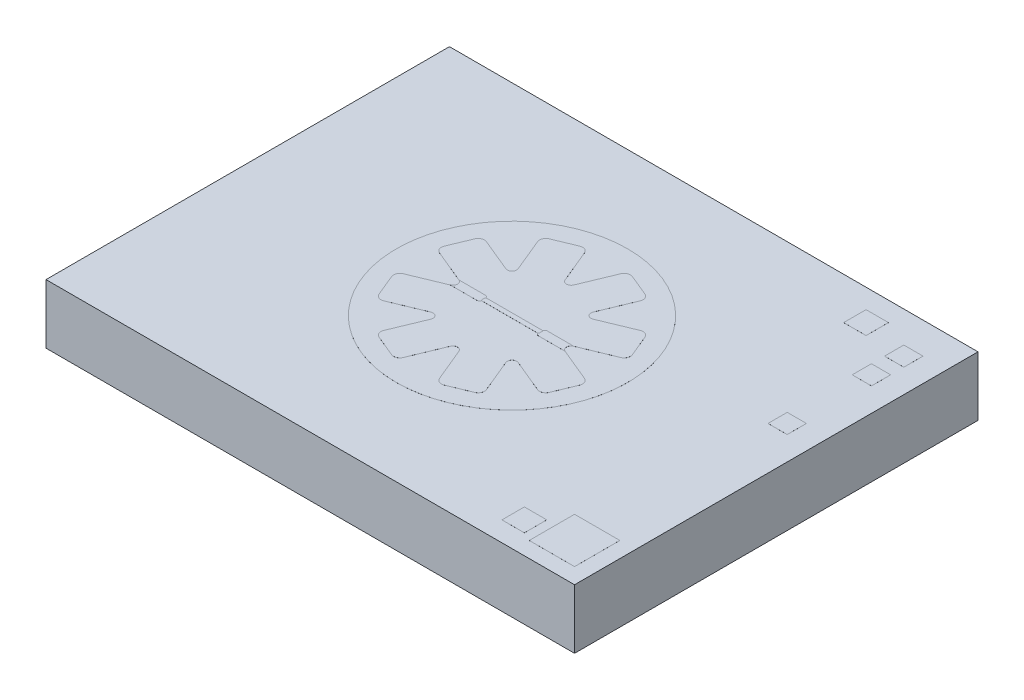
from build123d import *

# Parameters (mm, degrees)
SKETCH1_W                = 4.2926
SKETCH1_H                = 3.2766
DIE_DEPTH                = 0.4826
SKETCH2_R                = 0.9398
BOSS_EXTRUDE1_DEPTH      = 0.000254
BOSS_EXTRUDE2_DEPTH      = 0.000254
FILLET1_R                = 0.0381
FILLET2_R                = 0.0508
BOSS_EXTRUDE3_START      = 0.000254
BOSS_EXTRUDE3_DEPTH      = 0.000254
BOSS_EXTRUDE4_DEPTH      = 0.000508
SKETCH6_W                = 0.181991
SKETCH6_H                = 0.181991
SKETCH6_W_2              = 0.1560068
SKETCH6_H_2              = 0.1560068
SKETCH6_W_3              = 0.368046
SKETCH6_H_3              = 0.368046
TOP_PADS_DEPTH           = 0.000254
SKETCH9_W                = 0.127
SKETCH9_H                = 0.3059938
BOTTOM_PADS_DEPTH        = 0.000508
SKETCH7_W                = 1.521968
SKETCH7_H                = 0.3059938
BOTTOM_METAL_DEPTH       = 0.000254
SKETCH8_W                = 0.681736
SKETCH8_H                = 0.681736
KOH_ETCH_DEPTH           = 0.477854
KOH_ETCH_DRAFT           = -35.3
KOH_ETCH_PROFILE_2_DEPTH = 0.477854
KOH_ETCH_PROFILE_2_DRAFT = -35.3
SKETCH18_W               = 0.127
SKETCH18_H               = 0.3059938
CUT_EXTRUDE1_DEPTH       = 0.0254
CUT_EXTRUDE1_DRAFT       = -35.3


with BuildPart() as part:
    # Sketch1 → die (new body)
    with BuildSketch(Plane(origin=(0, 0, 0), x_dir=(1, 0, 0), z_dir=(0, 1, 0))):
        with Locations((2.1463, 1.6383)):
            Rectangle(SKETCH1_W, SKETCH1_H)
    extrude(amount=DIE_DEPTH)

    # Sketch2 → Boss-Extrude1 (add)
    with BuildSketch(Plane(origin=(0, 0.4826, 0), x_dir=(1, 0, 0), z_dir=(0, 1, 0))):
        with Locations(Location((2.1463, 1.6383, 0), (0, 0, 90))):
            Circle(SKETCH2_R)
    extrude(amount=BOSS_EXTRUDE1_DEPTH)

    # Sketch3 → Boss-Extrude2 (add)
    with BuildSketch(Plane(origin=(0, 0.482854, 0), x_dir=(1, 0, 0), z_dir=(0, 1, 0))):
        Polygon((1.7653, 1.6383), (1.363041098, 1.804921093), (1.474633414, 2.074328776), (1.876892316, 1.907707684), (1.710271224, 2.309966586), (1.979678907, 2.421558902), (2.1463, 2.0193), (2.312921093, 2.421558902), (2.582328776, 2.309966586), (2.415707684, 1.907707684), (2.817966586, 2.074328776), (2.929558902, 1.804921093), (2.5273, 1.6383), (2.929558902, 1.471678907), (2.817966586, 1.202271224), (2.415707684, 1.368892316), (2.582328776, 0.966633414), (2.312921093, 0.855041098), (2.1463, 1.2573), (1.979678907, 0.855041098), (1.710271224, 0.966633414), (1.876892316, 1.368892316), (1.474633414, 1.202271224), (1.363041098, 1.471678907), align=None)
    extrude(amount=BOSS_EXTRUDE2_DEPTH)

    # Fillet1
    fillet1_edges = [part.edges().sort_by_distance(p)[0] for p in [
        (1.7653, 0.482981, -1.6383),
        (1.876892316, 0.482981, -1.368892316),
        (2.1463, 0.482981, -1.2573),
        (2.415707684, 0.482981, -1.368892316),
        (2.5273, 0.482981, -1.6383),
        (2.415707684, 0.482981, -1.907707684),
        (2.1463, 0.482981, -2.0193),
        (1.876892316, 0.482981, -1.907707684),
    ]]
    fillet(fillet1_edges, radius=FILLET1_R)

    # Fillet2
    fillet2_edges = [part.edges().sort_by_distance(p)[0] for p in [
        (1.363041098, 0.482981, -1.471678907),
        (1.474633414, 0.482981, -1.202271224),
        (1.710271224, 0.482981, -0.966633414),
        (1.979678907, 0.482981, -0.855041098),
        (2.312921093, 0.482981, -0.855041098),
        (2.582328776, 0.482981, -0.966633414),
        (2.817966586, 0.482981, -1.202271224),
        (2.929558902, 0.482981, -1.471678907),
        (2.929558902, 0.482981, -1.804921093),
        (2.817966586, 0.482981, -2.074328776),
        (2.582328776, 0.482981, -2.309966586),
        (2.312921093, 0.482981, -2.421558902),
        (1.979678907, 0.482981, -2.421558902),
        (1.710271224, 0.482981, -2.309966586),
        (1.474633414, 0.482981, -2.074328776),
        (1.363041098, 0.482981, -1.804921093),
    ]]
    fillet(fillet2_edges, radius=FILLET2_R)

    # Sketch4 → Boss-Extrude3 (add)
    with BuildSketch(Plane(origin=(0, 0.483108, 0), x_dir=(1, 0, 0), z_dir=(0, 1, 0)).offset(BOSS_EXTRUDE3_START)):
        with BuildLine():
            Line((1.680320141, 1.60310019), (1.89520019, 1.60310019))
            ThreePointArc((1.89520019, 1.60310019), (1.911109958, 1.609690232), (1.9177, 1.6256))
            Line((1.9177, 1.6256), (2.3749, 1.6256))
            ThreePointArc((2.3749, 1.6256), (2.381490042, 1.609690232), (2.39739981, 1.60310019))
            Line((2.39739981, 1.60310019), (2.612279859, 1.60310019))
            ThreePointArc((2.612279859, 1.60310019), (2.588760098, 1.6383), (2.612279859, 1.67349981))
            Line((2.612279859, 1.67349981), (2.39739981, 1.67349981))
            ThreePointArc((2.39739981, 1.67349981), (2.381490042, 1.666909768), (2.3749, 1.651))
            Line((2.3749, 1.651), (1.9177, 1.651))
            ThreePointArc((1.9177, 1.651), (1.911109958, 1.666909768), (1.89520019, 1.67349981))
            Line((1.89520019, 1.67349981), (1.680320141, 1.67349981))
            ThreePointArc((1.680320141, 1.67349981), (1.703839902, 1.6383), (1.680320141, 1.60310019))
        make_face()
    extrude(amount=-BOSS_EXTRUDE3_DEPTH)

    # Sketch5 → Boss-Extrude4 (add)
    with BuildSketch(Plane(origin=(0, 0.483108, 0), x_dir=(1, 0, 0), z_dir=(0, 1, 0))):
        with BuildLine():
            Line((1.92024, 1.61925), (2.37236, 1.61925))
            ThreePointArc((2.37236, 1.61925), (2.377748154, 1.621481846), (2.37998, 1.62687))
            Line((2.37998, 1.62687), (2.37998, 1.64973))
            ThreePointArc((2.37998, 1.64973), (2.377748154, 1.655118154), (2.37236, 1.65735))
            Line((2.37236, 1.65735), (1.92024, 1.65735))
            ThreePointArc((1.92024, 1.65735), (1.914851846, 1.655118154), (1.91262, 1.64973))
            Line((1.91262, 1.64973), (1.91262, 1.62687))
            ThreePointArc((1.91262, 1.62687), (1.914851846, 1.621481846), (1.92024, 1.61925))
        make_face()
    extrude(amount=BOSS_EXTRUDE4_DEPTH)

    # Sketch6 → top pads (add)
    with BuildSketch(Plane(origin=(0, 0.4826, 0), x_dir=(1, 0, 0), z_dir=(0, 1, 0))):
        with Locations((3.6328096, 3.027299)):
            Rectangle(SKETCH6_W, SKETCH6_H)
        with Locations((4.0218106, 2.9447998)):
            Rectangle(SKETCH6_W_2, SKETCH6_H_2)
        with Locations((4.0218106, 2.6818082)):
            Rectangle(SKETCH6_W_2, SKETCH6_H_2)
        with Locations((4.0218106, 1.9978116)):
            Rectangle(SKETCH6_W_2, SKETCH6_H_2)
        with Locations((3.9812976, 0.3113024)):
            Rectangle(SKETCH6_W_3, SKETCH6_H_3)
        with Locations((3.6328096, 0.2522982)):
            Rectangle(SKETCH6_W, SKETCH6_H)
    extrude(amount=TOP_PADS_DEPTH)

    # Sketch9 → bottom pads (add)
    with BuildSketch(Plane.XZ):
        with Locations((3.844798, -2.5548082)):
            Rectangle(SKETCH9_W, SKETCH9_H)
        with Locations((3.844798, -1.6327882)):
            Rectangle(SKETCH9_W, SKETCH9_H)
        with Locations((3.844798, -0.724789)):
            Rectangle(SKETCH9_W, SKETCH9_H)
    extrude(amount=BOTTOM_PADS_DEPTH)

    # Sketch7 → bottom metal (add)
    with BuildSketch(Plane.XZ):
        Polygon((3.920998, -2.7078051), (1.567688, -2.7078051), (1.567688, -1.65354), (2.335784, -1.65354), (2.335784, -2.4018113), (3.920998, -2.4018113), align=None)
        Polygon((3.920998, -0.8747887), (3.920998, -0.5687949), (1.567688, -0.5687949), (1.567688, -1.62306), (2.335784, -1.62306), (2.335784, -0.8747887), align=None)
        with Locations((3.160014, -1.6327882)):
            Rectangle(SKETCH7_W, SKETCH7_H)
    extrude(amount=BOTTOM_METAL_DEPTH)


with BuildPart() as koh_etch_tool:
    # Sketch8 → KOH etch (with draft: the straight prism first)
    with BuildSketch(Plane.XZ.offset(0.000254)):
        with Locations((1.951736, -2.037588)):
            Rectangle(SKETCH8_W, SKETCH8_H)
    extrude(amount=-KOH_ETCH_DEPTH)
    # KOH etch: the draft: its side faces are tilted about the plane it starts from
    koh_etch_sides = [koh_etch_tool.faces().sort_by_distance(p)[0] for p in [
        (1.610868, 0.238673, -2.037588),
        (1.951736, 0.238673, -2.378456),
        (2.292604, 0.238673, -2.037588),
        (1.951736, 0.238673, -1.69672),
    ]]
    draft(koh_etch_sides, Plane.XZ.offset(0.000254), KOH_ETCH_DRAFT)


with BuildPart() as part_1:
    add(part.part)

    # KOH etch: cut by koh_etch_tool
    add(koh_etch_tool.part, mode=Mode.SUBTRACT)


with BuildPart() as koh_etch_profile_2_tool:
    # Sketch8 → KOH etch profile 2 (with draft: the straight prism first)
    with BuildSketch(Plane.XZ.offset(0.000254)):
        with Locations((1.951736, -1.239012)):
            Rectangle(SKETCH8_W, SKETCH8_H)
    extrude(amount=-KOH_ETCH_PROFILE_2_DEPTH)
    # KOH etch profile 2: the draft: its side faces are tilted about the plane it starts from
    koh_etch_profile_2_sides = [koh_etch_profile_2_tool.faces().sort_by_distance(p)[0] for p in [
        (2.292604, 0.238673, -1.239012),
        (1.951736, 0.238673, -0.898144),
        (1.610868, 0.238673, -1.239012),
        (1.951736, 0.238673, -1.57988),
    ]]
    draft(koh_etch_profile_2_sides, Plane.XZ.offset(0.000254), KOH_ETCH_PROFILE_2_DRAFT)


with BuildPart() as part_2:
    add(part_1.part)

    # KOH etch profile 2: cut by koh_etch_profile_2_tool
    add(koh_etch_profile_2_tool.part, mode=Mode.SUBTRACT)


with BuildPart() as cut_extrude1_tool:
    # Sketch18 → Cut-Extrude1 (with draft: the straight prism first)
    with BuildSketch(Plane.XZ.offset(0.000254)):
        with Locations((2.46253, -1.6327882)):
            Rectangle(SKETCH18_W, SKETCH18_H)
    extrude(amount=-CUT_EXTRUDE1_DEPTH)
    # Cut-Extrude1: the draft: its side faces are tilted about the plane it starts from
    cut_extrude1_sides = [cut_extrude1_tool.faces().sort_by_distance(p)[0] for p in [
        (2.46253, 0.012446, -1.7857851),
        (2.52603, 0.012446, -1.6327882),
        (2.46253, 0.012446, -1.4797913),
        (2.39903, 0.012446, -1.6327882),
    ]]
    draft(cut_extrude1_sides, Plane.XZ.offset(0.000254), CUT_EXTRUDE1_DRAFT)


with BuildPart() as part_3:
    add(part_2.part)

    # Cut-Extrude1: cut by cut_extrude1_tool
    add(cut_extrude1_tool.part, mode=Mode.SUBTRACT)


solid = part_3.part
